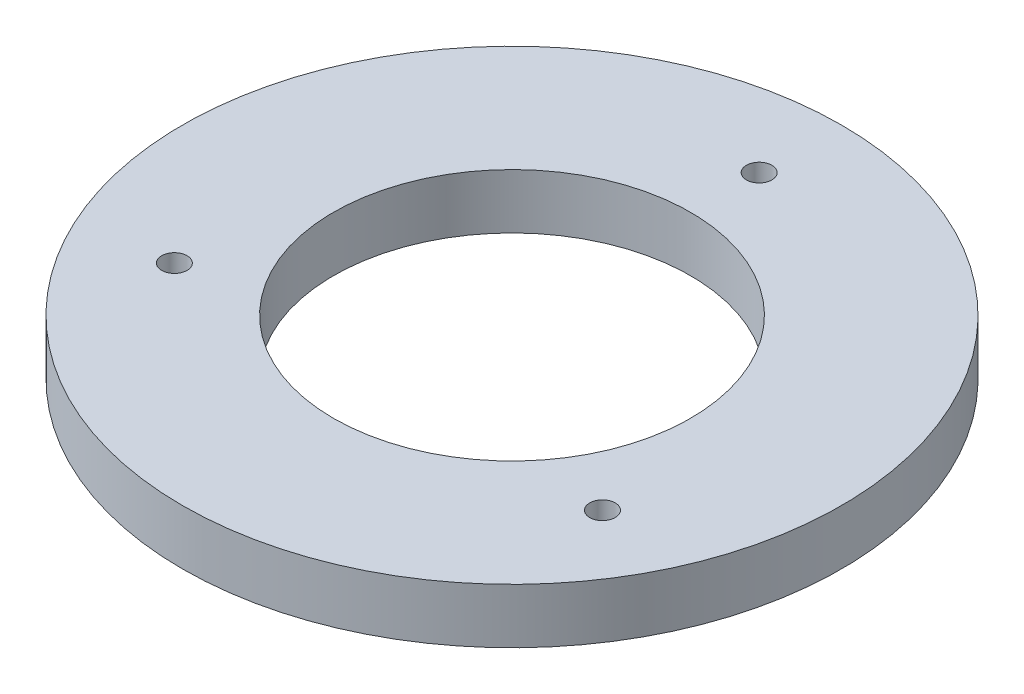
from build123d import *

# Parameters (mm, degrees)
SKETCH1_R           = 38.1
SKETCH1_R_2         = 1.4732
SKETCH1_R_3         = 20.6375
BOSS_EXTRUDE1_DEPTH = 6.35


with BuildPart() as part:
    # Sketch1 → Boss-Extrude1 (new body)
    with BuildSketch(Plane(origin=(0, 0, 0), x_dir=(1, 0, 0), z_dir=(0, 1, 0))):
        with Locations(Location((0, 0, 0), (0, 0, 270))):
            Circle(SKETCH1_R)
        with Locations(Location((0, 28.575, 0), (0, 0, 270))):
            Circle(SKETCH1_R_2, mode=Mode.SUBTRACT)
        with Locations(Location((24.746675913, -14.2875, 0), (0, 0, 270))):
            Circle(SKETCH1_R_2, mode=Mode.SUBTRACT)
        with Locations(Location((-24.746675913, -14.2875, 0), (0, 0, 270))):
            Circle(SKETCH1_R_2, mode=Mode.SUBTRACT)
        with Locations(Location((0, 0, 0), (0, 0, 270))):
            Circle(SKETCH1_R_3, mode=Mode.SUBTRACT)
    extrude(amount=BOSS_EXTRUDE1_DEPTH)


solid = part.part
